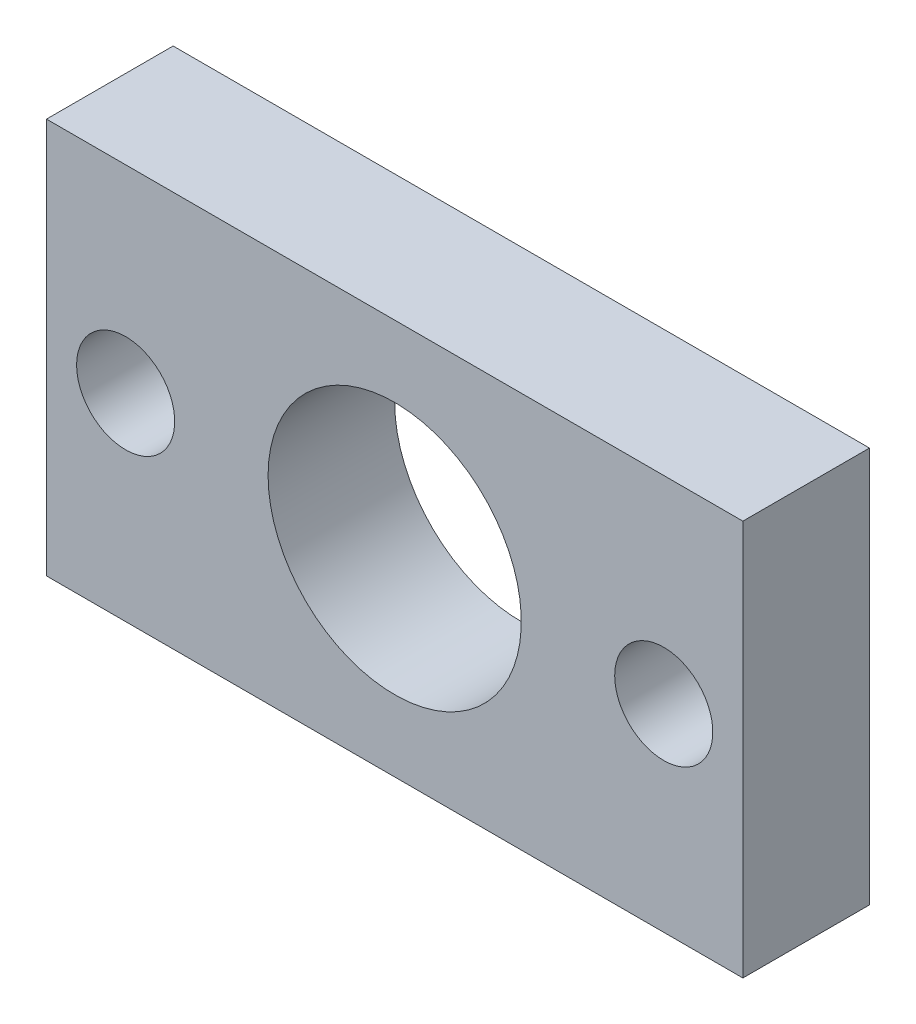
ISO-10303-21;
HEADER;
FILE_DESCRIPTION(('STEP AP214'),'2;1');
FILE_NAME('part.step','',(''),(''),'','','');
FILE_SCHEMA(('AUTOMOTIVE_DESIGN { 1 0 10303 214 1 1 1 1 }'));
ENDSEC;
DATA;
#1=APPLICATION_CONTEXT('core data for automotive mechanical design processes');
#2=APPLICATION_PROTOCOL_DEFINITION('international standard','automotive_design',2000,#1);
#3=PRODUCT_CONTEXT('',#1,'mechanical');
#4=PRODUCT('Part','Part','',(#3));
#5=PRODUCT_RELATED_PRODUCT_CATEGORY('part','',(#4));
#6=PRODUCT_DEFINITION_FORMATION('','',#4);
#7=PRODUCT_DEFINITION_CONTEXT('part definition',#1,'design');
#8=PRODUCT_DEFINITION('design','',#6,#7);
#9=PRODUCT_DEFINITION_SHAPE('','',#8);
#10=(LENGTH_UNIT() NAMED_UNIT(*) SI_UNIT(.MILLI.,.METRE.));
#11=(NAMED_UNIT(*) PLANE_ANGLE_UNIT() SI_UNIT($,.RADIAN.));
#12=(NAMED_UNIT(*) SI_UNIT($,.STERADIAN.) SOLID_ANGLE_UNIT());
#13=UNCERTAINTY_MEASURE_WITH_UNIT(LENGTH_MEASURE(1.E-05),#10,'distance_accuracy_value','');
#14=(GEOMETRIC_REPRESENTATION_CONTEXT(3) GLOBAL_UNCERTAINTY_ASSIGNED_CONTEXT((#13)) GLOBAL_UNIT_ASSIGNED_CONTEXT((#10,
#11,#12)) REPRESENTATION_CONTEXT('',''));
#15=CARTESIAN_POINT('',(0.,0.,0.));
#16=DIRECTION('',(0.,0.,1.));
#17=DIRECTION('',(1.,0.,0.));
#18=AXIS2_PLACEMENT_3D('',#15,#16,#17);
#19=CARTESIAN_POINT('',(22.,12.5,-4.));
#20=DIRECTION('',(0.,1.,0.));
#21=DIRECTION('',(0.,0.,1.));
#22=AXIS2_PLACEMENT_3D('',#19,#20,#21);
#23=PLANE('',#22);
#24=DIRECTION('',(-1.,0.,0.));
#25=VECTOR('',#24,1.);
#26=CARTESIAN_POINT('',(22.,12.5,4.));
#27=LINE('',#26,#25);
#28=CARTESIAN_POINT('',(22.,12.5,4.));
#29=VERTEX_POINT('',#28);
#30=CARTESIAN_POINT('',(-22.,12.5,4.));
#31=VERTEX_POINT('',#30);
#32=EDGE_CURVE('E100',#29,#31,#27,.T.);
#33=ORIENTED_EDGE('',*,*,#32,.F.);
#34=DIRECTION('',(0.,0.,1.));
#35=VECTOR('',#34,1.);
#36=CARTESIAN_POINT('',(22.,12.5,-4.));
#37=LINE('',#36,#35);
#38=CARTESIAN_POINT('',(22.,12.5,-4.));
#39=VERTEX_POINT('',#38);
#40=EDGE_CURVE('E11',#39,#29,#37,.T.);
#41=ORIENTED_EDGE('',*,*,#40,.F.);
#42=DIRECTION('',(-1.,0.,0.));
#43=VECTOR('',#42,1.);
#44=CARTESIAN_POINT('',(22.,12.5,-4.));
#45=LINE('',#44,#43);
#46=CARTESIAN_POINT('',(-22.,12.5,-4.));
#47=VERTEX_POINT('',#46);
#48=EDGE_CURVE('E93',#39,#47,#45,.T.);
#49=ORIENTED_EDGE('',*,*,#48,.T.);
#50=DIRECTION('',(0.,0.,1.));
#51=VECTOR('',#50,1.);
#52=CARTESIAN_POINT('',(-22.,12.5,-4.));
#53=LINE('',#52,#51);
#54=EDGE_CURVE('E38',#47,#31,#53,.T.);
#55=ORIENTED_EDGE('',*,*,#54,.T.);
#56=EDGE_LOOP('',(#33,#41,#49,#55));
#57=FACE_BOUND('',#56,.T.);
#58=ADVANCED_FACE('F35',(#57),#23,.T.);
#59=CARTESIAN_POINT('',(22.,-12.5,-4.));
#60=DIRECTION('',(1.,0.,0.));
#61=DIRECTION('',(0.,1.,0.));
#62=AXIS2_PLACEMENT_3D('',#59,#60,#61);
#63=PLANE('',#62);
#64=DIRECTION('',(0.,1.,0.));
#65=VECTOR('',#64,1.);
#66=CARTESIAN_POINT('',(22.,-12.5,4.));
#67=LINE('',#66,#65);
#68=CARTESIAN_POINT('',(22.,-12.5,4.));
#69=VERTEX_POINT('',#68);
#70=EDGE_CURVE('E95',#69,#29,#67,.T.);
#71=ORIENTED_EDGE('',*,*,#70,.F.);
#72=DIRECTION('',(0.,0.,1.));
#73=VECTOR('',#72,1.);
#74=CARTESIAN_POINT('',(22.,-12.5,-4.));
#75=LINE('',#74,#73);
#76=CARTESIAN_POINT('',(22.,-12.5,-4.));
#77=VERTEX_POINT('',#76);
#78=EDGE_CURVE('E44',#77,#69,#75,.T.);
#79=ORIENTED_EDGE('',*,*,#78,.F.);
#80=DIRECTION('',(0.,1.,0.));
#81=VECTOR('',#80,1.);
#82=CARTESIAN_POINT('',(22.,-12.5,-4.));
#83=LINE('',#82,#81);
#84=EDGE_CURVE('E90',#77,#39,#83,.T.);
#85=ORIENTED_EDGE('',*,*,#84,.T.);
#86=ORIENTED_EDGE('',*,*,#40,.T.);
#87=EDGE_LOOP('',(#71,#79,#85,#86));
#88=FACE_BOUND('',#87,.T.);
#89=ADVANCED_FACE('F111',(#88),#63,.T.);
#90=CARTESIAN_POINT('',(-22.,-12.5,-4.));
#91=DIRECTION('',(0.,-1.,0.));
#92=DIRECTION('',(0.,0.,-1.));
#93=AXIS2_PLACEMENT_3D('',#90,#91,#92);
#94=PLANE('',#93);
#95=DIRECTION('',(1.,0.,0.));
#96=VECTOR('',#95,1.);
#97=CARTESIAN_POINT('',(-22.,-12.5,4.));
#98=LINE('',#97,#96);
#99=CARTESIAN_POINT('',(-22.,-12.5,4.));
#100=VERTEX_POINT('',#99);
#101=EDGE_CURVE('E85',#100,#69,#98,.T.);
#102=ORIENTED_EDGE('',*,*,#101,.F.);
#103=DIRECTION('',(0.,0.,1.));
#104=VECTOR('',#103,1.);
#105=CARTESIAN_POINT('',(-22.,-12.5,-4.));
#106=LINE('',#105,#104);
#107=CARTESIAN_POINT('',(-22.,-12.5,-4.));
#108=VERTEX_POINT('',#107);
#109=EDGE_CURVE('E80',#108,#100,#106,.T.);
#110=ORIENTED_EDGE('',*,*,#109,.F.);
#111=DIRECTION('',(1.,0.,0.));
#112=VECTOR('',#111,1.);
#113=CARTESIAN_POINT('',(-22.,-12.5,-4.));
#114=LINE('',#113,#112);
#115=EDGE_CURVE('E83',#108,#77,#114,.T.);
#116=ORIENTED_EDGE('',*,*,#115,.T.);
#117=ORIENTED_EDGE('',*,*,#78,.T.);
#118=EDGE_LOOP('',(#102,#110,#116,#117));
#119=FACE_BOUND('',#118,.T.);
#120=ADVANCED_FACE('F82',(#119),#94,.T.);
#121=CARTESIAN_POINT('',(-22.,12.5,-4.));
#122=DIRECTION('',(-1.,0.,0.));
#123=DIRECTION('',(0.,-1.,0.));
#124=AXIS2_PLACEMENT_3D('',#121,#122,#123);
#125=PLANE('',#124);
#126=DIRECTION('',(0.,-1.,0.));
#127=VECTOR('',#126,1.);
#128=CARTESIAN_POINT('',(-22.,12.5,4.));
#129=LINE('',#128,#127);
#130=EDGE_CURVE('E103',#31,#100,#129,.T.);
#131=ORIENTED_EDGE('',*,*,#130,.F.);
#132=ORIENTED_EDGE('',*,*,#54,.F.);
#133=DIRECTION('',(0.,-1.,0.));
#134=VECTOR('',#133,1.);
#135=CARTESIAN_POINT('',(-22.,12.5,-4.));
#136=LINE('',#135,#134);
#137=EDGE_CURVE('E89',#47,#108,#136,.T.);
#138=ORIENTED_EDGE('',*,*,#137,.T.);
#139=ORIENTED_EDGE('',*,*,#109,.T.);
#140=EDGE_LOOP('',(#131,#132,#138,#139));
#141=FACE_BOUND('',#140,.T.);
#142=ADVANCED_FACE('F92',(#141),#125,.T.);
#143=CARTESIAN_POINT('',(0.,0.,-4.));
#144=DIRECTION('',(0.,0.,1.));
#145=DIRECTION('',(1.,0.,0.));
#146=AXIS2_PLACEMENT_3D('',#143,#144,#145);
#147=PLANE('',#146);
#148=CARTESIAN_POINT('',(17.,0.,-4.));
#149=DIRECTION('',(0.,0.,1.));
#150=DIRECTION('',(-1.,0.,0.));
#151=AXIS2_PLACEMENT_3D('',#148,#149,#150);
#152=CIRCLE('',#151,3.1);
#153=CARTESIAN_POINT('',(13.9,0.,-4.));
#154=VERTEX_POINT('',#153);
#155=EDGE_CURVE('E148',#154,#154,#152,.T.);
#156=ORIENTED_EDGE('',*,*,#155,.T.);
#157=EDGE_LOOP('',(#156));
#158=FACE_BOUND('',#157,.T.);
#159=CARTESIAN_POINT('',(-17.,0.,-4.));
#160=DIRECTION('',(0.,0.,1.));
#161=DIRECTION('',(-1.,0.,0.));
#162=AXIS2_PLACEMENT_3D('',#159,#160,#161);
#163=CIRCLE('',#162,3.1);
#164=CARTESIAN_POINT('',(-20.1,0.,-4.));
#165=VERTEX_POINT('',#164);
#166=EDGE_CURVE('E156',#165,#165,#163,.T.);
#167=ORIENTED_EDGE('',*,*,#166,.T.);
#168=EDGE_LOOP('',(#167));
#169=FACE_BOUND('',#168,.T.);
#170=CARTESIAN_POINT('',(0.,0.,-4.));
#171=DIRECTION('',(0.,0.,1.));
#172=DIRECTION('',(-1.,0.,0.));
#173=AXIS2_PLACEMENT_3D('',#170,#171,#172);
#174=CIRCLE('',#173,8.);
#175=CARTESIAN_POINT('',(-8.,0.,-4.));
#176=VERTEX_POINT('',#175);
#177=EDGE_CURVE('E104',#176,#176,#174,.T.);
#178=ORIENTED_EDGE('',*,*,#177,.T.);
#179=EDGE_LOOP('',(#178));
#180=FACE_BOUND('',#179,.T.);
#181=ORIENTED_EDGE('',*,*,#48,.F.);
#182=ORIENTED_EDGE('',*,*,#84,.F.);
#183=ORIENTED_EDGE('',*,*,#115,.F.);
#184=ORIENTED_EDGE('',*,*,#137,.F.);
#185=EDGE_LOOP('',(#181,#182,#183,#184));
#186=FACE_BOUND('',#185,.T.);
#187=ADVANCED_FACE('F88',(#158,#169,#180,#186),#147,.F.);
#188=CARTESIAN_POINT('',(0.,0.,4.));
#189=DIRECTION('',(0.,0.,1.));
#190=DIRECTION('',(1.,0.,0.));
#191=AXIS2_PLACEMENT_3D('',#188,#189,#190);
#192=PLANE('',#191);
#193=CARTESIAN_POINT('',(17.,0.,4.));
#194=DIRECTION('',(0.,0.,1.));
#195=DIRECTION('',(-1.,0.,0.));
#196=AXIS2_PLACEMENT_3D('',#193,#194,#195);
#197=CIRCLE('',#196,3.1);
#198=CARTESIAN_POINT('',(13.9,0.,4.));
#199=VERTEX_POINT('',#198);
#200=EDGE_CURVE('E151',#199,#199,#197,.T.);
#201=ORIENTED_EDGE('',*,*,#200,.F.);
#202=EDGE_LOOP('',(#201));
#203=FACE_BOUND('',#202,.T.);
#204=CARTESIAN_POINT('',(-17.,0.,4.));
#205=DIRECTION('',(0.,0.,1.));
#206=DIRECTION('',(-1.,0.,0.));
#207=AXIS2_PLACEMENT_3D('',#204,#205,#206);
#208=CIRCLE('',#207,3.1);
#209=CARTESIAN_POINT('',(-20.1,0.,4.));
#210=VERTEX_POINT('',#209);
#211=EDGE_CURVE('E153',#210,#210,#208,.T.);
#212=ORIENTED_EDGE('',*,*,#211,.F.);
#213=EDGE_LOOP('',(#212));
#214=FACE_BOUND('',#213,.T.);
#215=CARTESIAN_POINT('',(0.,0.,4.));
#216=DIRECTION('',(0.,0.,1.));
#217=DIRECTION('',(-1.,0.,0.));
#218=AXIS2_PLACEMENT_3D('',#215,#216,#217);
#219=CIRCLE('',#218,8.);
#220=CARTESIAN_POINT('',(-8.,0.,4.));
#221=VERTEX_POINT('',#220);
#222=EDGE_CURVE('E159',#221,#221,#219,.T.);
#223=ORIENTED_EDGE('',*,*,#222,.F.);
#224=EDGE_LOOP('',(#223));
#225=FACE_BOUND('',#224,.T.);
#226=ORIENTED_EDGE('',*,*,#32,.T.);
#227=ORIENTED_EDGE('',*,*,#130,.T.);
#228=ORIENTED_EDGE('',*,*,#101,.T.);
#229=ORIENTED_EDGE('',*,*,#70,.T.);
#230=EDGE_LOOP('',(#226,#227,#228,#229));
#231=FACE_BOUND('',#230,.T.);
#232=ADVANCED_FACE('F110',(#203,#214,#225,#231),#192,.T.);
#233=CARTESIAN_POINT('',(0.,0.,-4.));
#234=DIRECTION('',(0.,0.,1.));
#235=DIRECTION('',(1.,0.,0.));
#236=AXIS2_PLACEMENT_3D('',#233,#234,#235);
#237=CYLINDRICAL_SURFACE('',#236,8.);
#238=ORIENTED_EDGE('',*,*,#177,.F.);
#239=EDGE_LOOP('',(#238));
#240=FACE_BOUND('',#239,.T.);
#241=ORIENTED_EDGE('',*,*,#222,.T.);
#242=EDGE_LOOP('',(#241));
#243=FACE_BOUND('',#242,.T.);
#244=ADVANCED_FACE('F129',(#240,#243),#237,.F.);
#245=CARTESIAN_POINT('',(-17.,0.,-4.));
#246=DIRECTION('',(0.,0.,1.));
#247=DIRECTION('',(1.,0.,0.));
#248=AXIS2_PLACEMENT_3D('',#245,#246,#247);
#249=CYLINDRICAL_SURFACE('',#248,3.1);
#250=ORIENTED_EDGE('',*,*,#166,.F.);
#251=EDGE_LOOP('',(#250));
#252=FACE_BOUND('',#251,.T.);
#253=ORIENTED_EDGE('',*,*,#211,.T.);
#254=EDGE_LOOP('',(#253));
#255=FACE_BOUND('',#254,.T.);
#256=ADVANCED_FACE('F136',(#252,#255),#249,.F.);
#257=CARTESIAN_POINT('',(17.,0.,-4.));
#258=DIRECTION('',(0.,0.,1.));
#259=DIRECTION('',(1.,0.,0.));
#260=AXIS2_PLACEMENT_3D('',#257,#258,#259);
#261=CYLINDRICAL_SURFACE('',#260,3.1);
#262=ORIENTED_EDGE('',*,*,#155,.F.);
#263=EDGE_LOOP('',(#262));
#264=FACE_BOUND('',#263,.T.);
#265=ORIENTED_EDGE('',*,*,#200,.T.);
#266=EDGE_LOOP('',(#265));
#267=FACE_BOUND('',#266,.T.);
#268=ADVANCED_FACE('F140',(#264,#267),#261,.F.);
#269=CLOSED_SHELL('',(#58,#89,#120,#142,#187,#232,#244,#256,#268));
#270=MANIFOLD_SOLID_BREP('B2',#269);
#271=ADVANCED_BREP_SHAPE_REPRESENTATION('',(#18,#270),#14);
#272=SHAPE_DEFINITION_REPRESENTATION(#9,#271);
ENDSEC;
END-ISO-10303-21;
